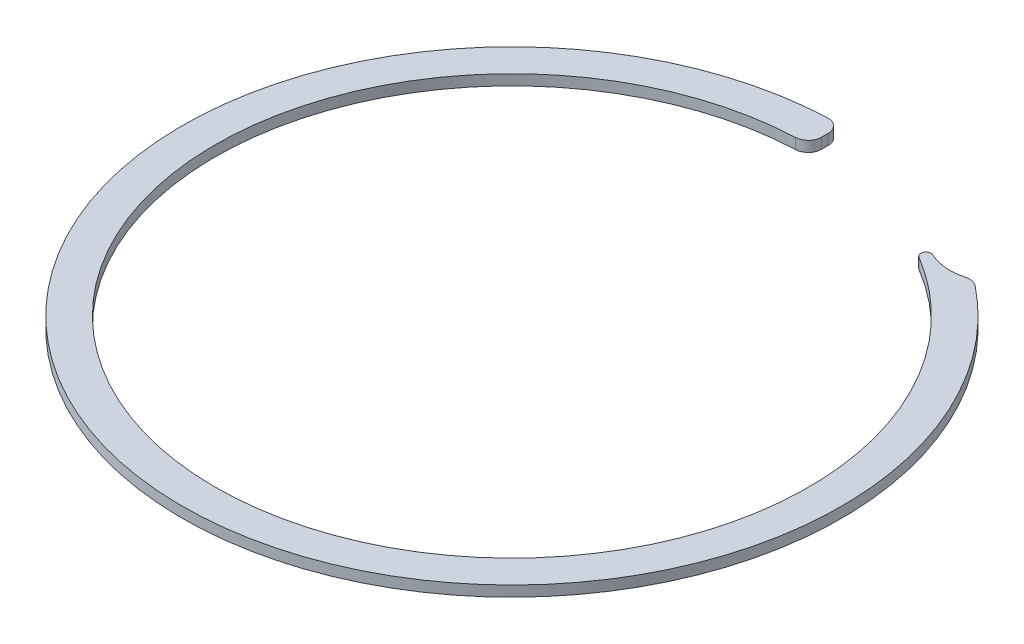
ISO-10303-21;
HEADER;
FILE_DESCRIPTION(('STEP AP214'),'2;1');
FILE_NAME('part.step','',(''),(''),'','','');
FILE_SCHEMA(('AUTOMOTIVE_DESIGN { 1 0 10303 214 1 1 1 1 }'));
ENDSEC;
DATA;
#1=APPLICATION_CONTEXT('core data for automotive mechanical design processes');
#2=APPLICATION_PROTOCOL_DEFINITION('international standard','automotive_design',2000,#1);
#3=PRODUCT_CONTEXT('',#1,'mechanical');
#4=PRODUCT('Part','Part','',(#3));
#5=PRODUCT_RELATED_PRODUCT_CATEGORY('part','',(#4));
#6=PRODUCT_DEFINITION_FORMATION('','',#4);
#7=PRODUCT_DEFINITION_CONTEXT('part definition',#1,'design');
#8=PRODUCT_DEFINITION('design','',#6,#7);
#9=PRODUCT_DEFINITION_SHAPE('','',#8);
#10=(LENGTH_UNIT() NAMED_UNIT(*) SI_UNIT(.MILLI.,.METRE.));
#11=(NAMED_UNIT(*) PLANE_ANGLE_UNIT() SI_UNIT($,.RADIAN.));
#12=(NAMED_UNIT(*) SI_UNIT($,.STERADIAN.) SOLID_ANGLE_UNIT());
#13=UNCERTAINTY_MEASURE_WITH_UNIT(LENGTH_MEASURE(1.E-05),#10,'distance_accuracy_value','');
#14=(GEOMETRIC_REPRESENTATION_CONTEXT(3) GLOBAL_UNCERTAINTY_ASSIGNED_CONTEXT((#13)) GLOBAL_UNIT_ASSIGNED_CONTEXT((#10,
#11,#12)) REPRESENTATION_CONTEXT('',''));
#15=CARTESIAN_POINT('',(0.,0.,0.));
#16=DIRECTION('',(0.,0.,1.));
#17=DIRECTION('',(1.,0.,0.));
#18=AXIS2_PLACEMENT_3D('',#15,#16,#17);
#19=CARTESIAN_POINT('',(11.9369382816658,-0.0799999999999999,-19.9728376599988));
#20=CARTESIAN_POINT('',(11.9369382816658,-0.0533333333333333,-19.9728376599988));
#21=CARTESIAN_POINT('',(11.9369382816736,-0.0266666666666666,-19.9728376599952));
#22=CARTESIAN_POINT('',(11.9369382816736,0.266666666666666,-19.9728376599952));
#23=CARTESIAN_POINT('',(11.9369382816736,0.533333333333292,-19.9728376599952));
#24=CARTESIAN_POINT('',(11.9369382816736,0.826666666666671,-19.9728376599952));
#25=CARTESIAN_POINT('',(11.9369382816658,0.853333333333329,-19.9728376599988));
#26=CARTESIAN_POINT('',(11.9369382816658,0.88,-19.9728376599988));
#27=CARTESIAN_POINT('',(11.3057503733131,-0.0799999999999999,-20.2666545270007));
#28=CARTESIAN_POINT('',(11.3057503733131,-0.0533333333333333,-20.2666545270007));
#29=CARTESIAN_POINT('',(11.3057503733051,-0.0266666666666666,-20.2666545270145));
#30=CARTESIAN_POINT('',(11.3057503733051,0.266666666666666,-20.2666545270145));
#31=CARTESIAN_POINT('',(11.3057503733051,0.533333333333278,-20.2666545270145));
#32=CARTESIAN_POINT('',(11.3057503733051,0.826666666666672,-20.2666545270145));
#33=CARTESIAN_POINT('',(11.3057503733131,0.853333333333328,-20.2666545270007));
#34=CARTESIAN_POINT('',(11.3057503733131,0.88,-20.2666545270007));
#35=CARTESIAN_POINT('',(10.9792901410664,-0.0799999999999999,-19.6517153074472));
#36=CARTESIAN_POINT('',(10.9792901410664,-0.0533333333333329,-19.6517153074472));
#37=CARTESIAN_POINT('',(10.9792901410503,-0.0266666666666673,-19.6517153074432));
#38=CARTESIAN_POINT('',(10.9792901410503,0.266666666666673,-19.6517153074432));
#39=CARTESIAN_POINT('',(10.9792901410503,0.533333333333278,-19.6517153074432));
#40=CARTESIAN_POINT('',(10.9792901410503,0.826666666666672,-19.6517153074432));
#41=CARTESIAN_POINT('',(10.9792901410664,0.853333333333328,-19.6517153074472));
#42=CARTESIAN_POINT('',(10.9792901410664,0.88,-19.6517153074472));
#43=CARTESIAN_POINT('',(11.5762938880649,-0.0799999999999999,-19.2935071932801));
#44=CARTESIAN_POINT('',(11.5762938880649,-0.0533333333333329,-19.2935071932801));
#45=CARTESIAN_POINT('',(11.5762938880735,-0.0266666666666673,-19.2935071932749));
#46=CARTESIAN_POINT('',(11.5762938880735,0.266666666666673,-19.2935071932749));
#47=CARTESIAN_POINT('',(11.5762938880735,0.533333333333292,-19.2935071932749));
#48=CARTESIAN_POINT('',(11.5762938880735,0.826666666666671,-19.2935071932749));
#49=CARTESIAN_POINT('',(11.5762938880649,0.853333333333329,-19.2935071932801));
#50=CARTESIAN_POINT('',(11.5762938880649,0.88,-19.2935071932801));
#51=(BOUNDED_SURFACE() B_SPLINE_SURFACE(3,3,((#19,#20,#21,#22,#23,#24,#25,#26),(#27,#28,#29,#30,
#31,#32,#33,#34),(#35,#36,#37,#38,#39,#40,#41,#42),(#43,#44,#45,#46,#47,#48,#49,#50)),
.UNSPECIFIED.,.F.,.F.,.F.) B_SPLINE_SURFACE_WITH_KNOTS((4,4),(4,2,2,4),(0.,1.),(-0.1,0.,1.,1.1),
.UNSPECIFIED.) GEOMETRIC_REPRESENTATION_ITEM() RATIONAL_B_SPLINE_SURFACE(((1.,1.,1.,1.,1.,1.,1.,
1.),(0.368237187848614,0.368237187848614,0.368237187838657,0.368237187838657,0.368237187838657,
0.368237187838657,0.368237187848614,0.368237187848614),(0.368237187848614,0.368237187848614,
0.368237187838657,0.368237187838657,0.368237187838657,0.368237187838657,0.368237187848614,
0.368237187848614),(1.,1.,1.,1.,1.,1.,1.,1.))) REPRESENTATION_ITEM('') SURFACE());
#52=CARTESIAN_POINT('',(11.9369382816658,0.88,-19.9728376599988));
#53=CARTESIAN_POINT('',(11.9369382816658,0.853333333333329,-19.9728376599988));
#54=CARTESIAN_POINT('',(11.9369382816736,0.826666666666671,-19.9728376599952));
#55=CARTESIAN_POINT('',(11.9369382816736,0.533333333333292,-19.9728376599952));
#56=CARTESIAN_POINT('',(11.9369382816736,0.266666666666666,-19.9728376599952));
#57=CARTESIAN_POINT('',(11.9369382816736,-0.0266666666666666,-19.9728376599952));
#58=CARTESIAN_POINT('',(11.9369382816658,-0.0533333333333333,-19.9728376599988));
#59=CARTESIAN_POINT('',(11.9369382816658,-0.0799999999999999,-19.9728376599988));
#60=(BOUNDED_CURVE() B_SPLINE_CURVE(3,(#52,#53,#54,#55,#56,#57,#58,#59),.UNSPECIFIED.,.F.,
.F.) B_SPLINE_CURVE_WITH_KNOTS((4,2,2,4),(-0.1,0.,1.,1.1),
.UNSPECIFIED.) CURVE() GEOMETRIC_REPRESENTATION_ITEM() RATIONAL_B_SPLINE_CURVE((1.,1.,1.,1.,1.,
1.,1.,1.)) REPRESENTATION_ITEM(''));
#61=CARTESIAN_POINT('',(11.9369382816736,0.,-19.9728376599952));
#62=VERTEX_POINT('',#61);
#63=CARTESIAN_POINT('',(11.9369382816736,0.8,-19.9728376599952));
#64=VERTEX_POINT('',#63);
#65=EDGE_CURVE('E156',#62,#64,#60,.F.);
#66=CARTESIAN_POINT('',(11.9369382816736,0.,-19.9728376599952));
#67=CARTESIAN_POINT('',(11.3057503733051,0.,-20.2666545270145));
#68=CARTESIAN_POINT('',(10.9792901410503,0.,-19.6517153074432));
#69=CARTESIAN_POINT('',(11.5762938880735,0.,-19.2935071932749));
#70=(BOUNDED_CURVE() B_SPLINE_CURVE(3,(#66,#67,#68,#69),.UNSPECIFIED.,.F.,
.F.) B_SPLINE_CURVE_WITH_KNOTS((4,4),(0.,1.),
.UNSPECIFIED.) CURVE() GEOMETRIC_REPRESENTATION_ITEM() RATIONAL_B_SPLINE_CURVE((1.,
0.368237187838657,0.368237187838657,1.)) REPRESENTATION_ITEM(''));
#71=CARTESIAN_POINT('',(11.5762938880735,0.,-19.2935071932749));
#72=VERTEX_POINT('',#71);
#73=EDGE_CURVE('E52',#72,#62,#70,.F.);
#74=CARTESIAN_POINT('',(11.5762938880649,-0.0799999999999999,-19.2935071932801));
#75=CARTESIAN_POINT('',(11.5762938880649,-0.0533333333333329,-19.2935071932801));
#76=CARTESIAN_POINT('',(11.5762938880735,-0.0266666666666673,-19.2935071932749));
#77=CARTESIAN_POINT('',(11.5762938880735,0.266666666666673,-19.2935071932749));
#78=CARTESIAN_POINT('',(11.5762938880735,0.533333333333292,-19.2935071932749));
#79=CARTESIAN_POINT('',(11.5762938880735,0.826666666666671,-19.2935071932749));
#80=CARTESIAN_POINT('',(11.5762938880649,0.853333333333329,-19.2935071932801));
#81=CARTESIAN_POINT('',(11.5762938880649,0.88,-19.2935071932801));
#82=(BOUNDED_CURVE() B_SPLINE_CURVE(3,(#74,#75,#76,#77,#78,#79,#80,#81),.UNSPECIFIED.,.F.,
.F.) B_SPLINE_CURVE_WITH_KNOTS((4,2,2,4),(-0.1,0.,1.,1.1),
.UNSPECIFIED.) CURVE() GEOMETRIC_REPRESENTATION_ITEM() RATIONAL_B_SPLINE_CURVE((1.,1.,1.,1.,1.,
1.,1.,1.)) REPRESENTATION_ITEM(''));
#83=CARTESIAN_POINT('',(11.5762938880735,0.8,-19.2935071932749));
#84=VERTEX_POINT('',#83);
#85=EDGE_CURVE('E181',#84,#72,#82,.F.);
#86=CARTESIAN_POINT('',(11.5762938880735,0.8,-19.2935071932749));
#87=CARTESIAN_POINT('',(10.9792901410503,0.8,-19.6517153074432));
#88=CARTESIAN_POINT('',(11.3057503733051,0.8,-20.2666545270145));
#89=CARTESIAN_POINT('',(11.9369382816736,0.8,-19.9728376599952));
#90=(BOUNDED_CURVE() B_SPLINE_CURVE(3,(#86,#87,#88,#89),.UNSPECIFIED.,.F.,
.F.) B_SPLINE_CURVE_WITH_KNOTS((4,4),(0.,1.),
.UNSPECIFIED.) CURVE() GEOMETRIC_REPRESENTATION_ITEM() RATIONAL_B_SPLINE_CURVE((1.,
0.368237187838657,0.368237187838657,1.)) REPRESENTATION_ITEM(''));
#91=EDGE_CURVE('E11',#64,#84,#90,.F.);
#92=ORIENTED_EDGE('',*,*,#65,.F.);
#93=ORIENTED_EDGE('',*,*,#73,.F.);
#94=ORIENTED_EDGE('',*,*,#85,.F.);
#95=ORIENTED_EDGE('',*,*,#91,.F.);
#96=EDGE_LOOP('',(#92,#93,#94,#95));
#97=FACE_BOUND('',#96,.T.);
#98=ADVANCED_FACE('F39',(#97),#51,.T.);
#99=CARTESIAN_POINT('',(0.,0.8,0.));
#100=DIRECTION('',(0.,1.,0.));
#101=DIRECTION('',(0.,0.,1.));
#102=AXIS2_PLACEMENT_3D('',#99,#100,#101);
#103=PLANE('',#102);
#104=CARTESIAN_POINT('',(13.6249999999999,0.8,-23.599192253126));
#105=DIRECTION('',(0.,1.,0.));
#106=DIRECTION('',(0.,0.,1.));
#107=AXIS2_PLACEMENT_3D('',#104,#105,#106);
#108=CIRCLE('',#107,3.99999999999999);
#109=CARTESIAN_POINT('',(14.6827334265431,0.8,-19.7415764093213));
#110=VERTEX_POINT('',#109);
#111=EDGE_CURVE('E157',#64,#110,#108,.T.);
#112=ORIENTED_EDGE('',*,*,#111,.F.);
#113=ORIENTED_EDGE('',*,*,#91,.T.);
#114=CARTESIAN_POINT('',(0.,0.8,0.));
#115=DIRECTION('',(0.,1.,0.));
#116=DIRECTION('',(0.,0.,1.));
#117=AXIS2_PLACEMENT_3D('',#114,#115,#116);
#118=CIRCLE('',#117,22.5);
#119=CARTESIAN_POINT('',(-0.957446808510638,0.8,-22.4796195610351));
#120=VERTEX_POINT('',#119);
#121=EDGE_CURVE('E172',#120,#84,#118,.T.);
#122=ORIENTED_EDGE('',*,*,#121,.F.);
#123=CARTESIAN_POINT('',(-1.,0.8,-23.4787137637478));
#124=DIRECTION('',(0.,1.,0.));
#125=DIRECTION('',(0.,0.,1.));
#126=AXIS2_PLACEMENT_3D('',#123,#124,#125);
#127=CIRCLE('',#126,1.);
#128=CARTESIAN_POINT('',(0.,0.8,-23.4787137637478));
#129=VERTEX_POINT('',#128);
#130=EDGE_CURVE('E120',#120,#129,#127,.T.);
#131=ORIENTED_EDGE('',*,*,#130,.T.);
#132=DIRECTION('',(0.,0.,1.));
#133=VECTOR('',#132,1.);
#134=CARTESIAN_POINT('',(0.,0.8,0.));
#135=LINE('',#134,#133);
#136=CARTESIAN_POINT('',(0.,0.8,-23.9791576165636));
#137=VERTEX_POINT('',#136);
#138=EDGE_CURVE('E114',#137,#129,#135,.T.);
#139=ORIENTED_EDGE('',*,*,#138,.F.);
#140=CARTESIAN_POINT('',(-1.,0.8,-23.9791576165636));
#141=DIRECTION('',(0.,1.,0.));
#142=DIRECTION('',(0.,0.,1.));
#143=AXIS2_PLACEMENT_3D('',#140,#141,#142);
#144=CIRCLE('',#143,1.);
#145=CARTESIAN_POINT('',(-1.04166666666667,0.8,-24.9782891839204));
#146=VERTEX_POINT('',#145);
#147=EDGE_CURVE('E108',#137,#146,#144,.T.);
#148=ORIENTED_EDGE('',*,*,#147,.T.);
#149=CARTESIAN_POINT('',(0.,0.8,0.));
#150=DIRECTION('',(0.,1.,0.));
#151=DIRECTION('',(0.,0.,1.));
#152=AXIS2_PLACEMENT_3D('',#149,#150,#151);
#153=CIRCLE('',#152,25.);
#154=CARTESIAN_POINT('',(15.5699653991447,0.8,-19.5595546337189));
#155=VERTEX_POINT('',#154);
#156=EDGE_CURVE('E112',#146,#155,#153,.T.);
#157=ORIENTED_EDGE('',*,*,#156,.T.);
#158=CARTESIAN_POINT('',(14.947166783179,0.8,-18.7771724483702));
#159=DIRECTION('',(0.,1.,0.));
#160=DIRECTION('',(0.,0.,1.));
#161=AXIS2_PLACEMENT_3D('',#158,#159,#160);
#162=CIRCLE('',#161,1.);
#163=EDGE_CURVE('E119',#155,#110,#162,.T.);
#164=ORIENTED_EDGE('',*,*,#163,.T.);
#165=EDGE_LOOP('',(#112,#113,#122,#131,#139,#148,#157,#164));
#166=FACE_BOUND('',#165,.T.);
#167=ADVANCED_FACE('F110',(#166),#103,.T.);
#168=CARTESIAN_POINT('',(0.,0.,0.));
#169=DIRECTION('',(0.,1.,0.));
#170=DIRECTION('',(0.,0.,1.));
#171=AXIS2_PLACEMENT_3D('',#168,#169,#170);
#172=PLANE('',#171);
#173=CARTESIAN_POINT('',(0.,0.,0.));
#174=DIRECTION('',(0.,1.,0.));
#175=DIRECTION('',(0.,0.,1.));
#176=AXIS2_PLACEMENT_3D('',#173,#174,#175);
#177=CIRCLE('',#176,22.5);
#178=CARTESIAN_POINT('',(-0.957446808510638,0.,-22.4796195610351));
#179=VERTEX_POINT('',#178);
#180=EDGE_CURVE('E176',#179,#72,#177,.T.);
#181=ORIENTED_EDGE('',*,*,#180,.T.);
#182=ORIENTED_EDGE('',*,*,#73,.T.);
#183=CARTESIAN_POINT('',(13.6249999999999,0.,-23.599192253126));
#184=DIRECTION('',(0.,1.,0.));
#185=DIRECTION('',(0.,0.,1.));
#186=AXIS2_PLACEMENT_3D('',#183,#184,#185);
#187=CIRCLE('',#186,3.99999999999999);
#188=CARTESIAN_POINT('',(14.6827334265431,0.,-19.7415764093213));
#189=VERTEX_POINT('',#188);
#190=EDGE_CURVE('E160',#62,#189,#187,.T.);
#191=ORIENTED_EDGE('',*,*,#190,.T.);
#192=CARTESIAN_POINT('',(14.947166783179,0.,-18.7771724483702));
#193=DIRECTION('',(0.,1.,0.));
#194=DIRECTION('',(0.,0.,1.));
#195=AXIS2_PLACEMENT_3D('',#192,#193,#194);
#196=CIRCLE('',#195,1.);
#197=CARTESIAN_POINT('',(15.5699653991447,0.,-19.5595546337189));
#198=VERTEX_POINT('',#197);
#199=EDGE_CURVE('E147',#189,#198,#196,.F.);
#200=ORIENTED_EDGE('',*,*,#199,.T.);
#201=CARTESIAN_POINT('',(0.,0.,0.));
#202=DIRECTION('',(0.,1.,0.));
#203=DIRECTION('',(0.,0.,1.));
#204=AXIS2_PLACEMENT_3D('',#201,#202,#203);
#205=CIRCLE('',#204,25.);
#206=CARTESIAN_POINT('',(-1.04166666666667,0.,-24.9782891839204));
#207=VERTEX_POINT('',#206);
#208=EDGE_CURVE('E130',#207,#198,#205,.T.);
#209=ORIENTED_EDGE('',*,*,#208,.F.);
#210=CARTESIAN_POINT('',(-1.,0.,-23.9791576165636));
#211=DIRECTION('',(0.,1.,0.));
#212=DIRECTION('',(0.,0.,1.));
#213=AXIS2_PLACEMENT_3D('',#210,#211,#212);
#214=CIRCLE('',#213,1.);
#215=CARTESIAN_POINT('',(0.,0.,-23.9791576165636));
#216=VERTEX_POINT('',#215);
#217=EDGE_CURVE('E134',#207,#216,#214,.F.);
#218=ORIENTED_EDGE('',*,*,#217,.T.);
#219=DIRECTION('',(0.,0.,1.));
#220=VECTOR('',#219,1.);
#221=CARTESIAN_POINT('',(0.,0.,0.));
#222=LINE('',#221,#220);
#223=CARTESIAN_POINT('',(0.,0.,-23.4787137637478));
#224=VERTEX_POINT('',#223);
#225=EDGE_CURVE('E166',#216,#224,#222,.T.);
#226=ORIENTED_EDGE('',*,*,#225,.T.);
#227=CARTESIAN_POINT('',(-1.,0.,-23.4787137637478));
#228=DIRECTION('',(0.,1.,0.));
#229=DIRECTION('',(0.,0.,1.));
#230=AXIS2_PLACEMENT_3D('',#227,#228,#229);
#231=CIRCLE('',#230,1.);
#232=EDGE_CURVE('E144',#224,#179,#231,.F.);
#233=ORIENTED_EDGE('',*,*,#232,.T.);
#234=EDGE_LOOP('',(#181,#182,#191,#200,#209,#218,#226,#233));
#235=FACE_BOUND('',#234,.T.);
#236=ADVANCED_FACE('F205',(#235),#172,.F.);
#237=CARTESIAN_POINT('',(0.,0.8,0.));
#238=DIRECTION('',(0.,-1.,0.));
#239=DIRECTION('',(0.,0.,-1.));
#240=AXIS2_PLACEMENT_3D('',#237,#238,#239);
#241=CYLINDRICAL_SURFACE('',#240,25.);
#242=ORIENTED_EDGE('',*,*,#208,.T.);
#243=DIRECTION('',(0.,-1.,0.));
#244=VECTOR('',#243,1.);
#245=CARTESIAN_POINT('',(15.5699653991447,0.8,-19.5595546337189));
#246=LINE('',#245,#244);
#247=EDGE_CURVE('E129',#198,#155,#246,.F.);
#248=ORIENTED_EDGE('',*,*,#247,.T.);
#249=ORIENTED_EDGE('',*,*,#156,.F.);
#250=DIRECTION('',(0.,-1.,0.));
#251=VECTOR('',#250,1.);
#252=CARTESIAN_POINT('',(-1.04166666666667,0.8,-24.9782891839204));
#253=LINE('',#252,#251);
#254=EDGE_CURVE('E126',#146,#207,#253,.T.);
#255=ORIENTED_EDGE('',*,*,#254,.T.);
#256=EDGE_LOOP('',(#242,#248,#249,#255));
#257=FACE_BOUND('',#256,.T.);
#258=ADVANCED_FACE('F125',(#257),#241,.T.);
#259=CARTESIAN_POINT('',(0.,0.8,0.));
#260=DIRECTION('',(0.,-1.,0.));
#261=DIRECTION('',(0.,0.,-1.));
#262=AXIS2_PLACEMENT_3D('',#259,#260,#261);
#263=CYLINDRICAL_SURFACE('',#262,22.5);
#264=ORIENTED_EDGE('',*,*,#121,.T.);
#265=ORIENTED_EDGE('',*,*,#85,.T.);
#266=ORIENTED_EDGE('',*,*,#180,.F.);
#267=DIRECTION('',(0.,-1.,0.));
#268=VECTOR('',#267,1.);
#269=CARTESIAN_POINT('',(-0.957446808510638,0.8,-22.4796195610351));
#270=LINE('',#269,#268);
#271=EDGE_CURVE('E154',#179,#120,#270,.F.);
#272=ORIENTED_EDGE('',*,*,#271,.T.);
#273=EDGE_LOOP('',(#264,#265,#266,#272));
#274=FACE_BOUND('',#273,.T.);
#275=ADVANCED_FACE('F188',(#274),#263,.F.);
#276=CARTESIAN_POINT('',(0.,0.,0.));
#277=DIRECTION('',(-1.,0.,0.));
#278=DIRECTION('',(0.,0.,1.));
#279=AXIS2_PLACEMENT_3D('',#276,#277,#278);
#280=PLANE('',#279);
#281=ORIENTED_EDGE('',*,*,#225,.F.);
#282=DIRECTION('',(0.,-1.,0.));
#283=VECTOR('',#282,1.);
#284=CARTESIAN_POINT('',(0.,0.,-23.9791576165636));
#285=LINE('',#284,#283);
#286=EDGE_CURVE('E152',#216,#137,#285,.F.);
#287=ORIENTED_EDGE('',*,*,#286,.T.);
#288=ORIENTED_EDGE('',*,*,#138,.T.);
#289=DIRECTION('',(0.,1.,0.));
#290=VECTOR('',#289,1.);
#291=CARTESIAN_POINT('',(0.,0.,-23.4787137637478));
#292=LINE('',#291,#290);
#293=EDGE_CURVE('E149',#129,#224,#292,.F.);
#294=ORIENTED_EDGE('',*,*,#293,.T.);
#295=EDGE_LOOP('',(#281,#287,#288,#294));
#296=FACE_BOUND('',#295,.T.);
#297=ADVANCED_FACE('F198',(#296),#280,.F.);
#298=CARTESIAN_POINT('',(13.6249999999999,0.,-23.599192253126));
#299=DIRECTION('',(0.,1.,0.));
#300=DIRECTION('',(0.,0.,1.));
#301=AXIS2_PLACEMENT_3D('',#298,#299,#300);
#302=CYLINDRICAL_SURFACE('',#301,3.99999999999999);
#303=ORIENTED_EDGE('',*,*,#190,.F.);
#304=ORIENTED_EDGE('',*,*,#65,.T.);
#305=ORIENTED_EDGE('',*,*,#111,.T.);
#306=DIRECTION('',(0.,1.,0.));
#307=VECTOR('',#306,1.);
#308=CARTESIAN_POINT('',(14.6827334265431,0.,-19.7415764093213));
#309=LINE('',#308,#307);
#310=EDGE_CURVE('E141',#110,#189,#309,.F.);
#311=ORIENTED_EDGE('',*,*,#310,.T.);
#312=EDGE_LOOP('',(#303,#304,#305,#311));
#313=FACE_BOUND('',#312,.T.);
#314=ADVANCED_FACE('F199',(#313),#302,.F.);
#315=CARTESIAN_POINT('',(14.947166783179,0.,-18.7771724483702));
#316=DIRECTION('',(0.,-1.,0.));
#317=DIRECTION('',(0.,0.,-1.));
#318=AXIS2_PLACEMENT_3D('',#315,#316,#317);
#319=CYLINDRICAL_SURFACE('',#318,1.);
#320=ORIENTED_EDGE('',*,*,#199,.F.);
#321=ORIENTED_EDGE('',*,*,#310,.F.);
#322=ORIENTED_EDGE('',*,*,#163,.F.);
#323=ORIENTED_EDGE('',*,*,#247,.F.);
#324=EDGE_LOOP('',(#320,#321,#322,#323));
#325=FACE_BOUND('',#324,.T.);
#326=ADVANCED_FACE('F248',(#325),#319,.T.);
#327=CARTESIAN_POINT('',(-1.,0.8,-23.9791576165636));
#328=DIRECTION('',(0.,-1.,0.));
#329=DIRECTION('',(0.,0.,-1.));
#330=AXIS2_PLACEMENT_3D('',#327,#328,#329);
#331=CYLINDRICAL_SURFACE('',#330,1.);
#332=ORIENTED_EDGE('',*,*,#217,.F.);
#333=ORIENTED_EDGE('',*,*,#254,.F.);
#334=ORIENTED_EDGE('',*,*,#147,.F.);
#335=ORIENTED_EDGE('',*,*,#286,.F.);
#336=EDGE_LOOP('',(#332,#333,#334,#335));
#337=FACE_BOUND('',#336,.T.);
#338=ADVANCED_FACE('F133',(#337),#331,.T.);
#339=CARTESIAN_POINT('',(-1.,0.8,-23.4787137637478));
#340=DIRECTION('',(0.,-1.,0.));
#341=DIRECTION('',(0.,0.,-1.));
#342=AXIS2_PLACEMENT_3D('',#339,#340,#341);
#343=CYLINDRICAL_SURFACE('',#342,1.);
#344=ORIENTED_EDGE('',*,*,#130,.F.);
#345=ORIENTED_EDGE('',*,*,#271,.F.);
#346=ORIENTED_EDGE('',*,*,#232,.F.);
#347=ORIENTED_EDGE('',*,*,#293,.F.);
#348=EDGE_LOOP('',(#344,#345,#346,#347));
#349=FACE_BOUND('',#348,.T.);
#350=ADVANCED_FACE('F255',(#349),#343,.T.);
#351=CLOSED_SHELL('',(#98,#167,#236,#258,#275,#297,#314,#326,#338,#350));
#352=MANIFOLD_SOLID_BREP('B2',#351);
#353=ADVANCED_BREP_SHAPE_REPRESENTATION('',(#18,#352),#14);
#354=SHAPE_DEFINITION_REPRESENTATION(#9,#353);
ENDSEC;
END-ISO-10303-21;
